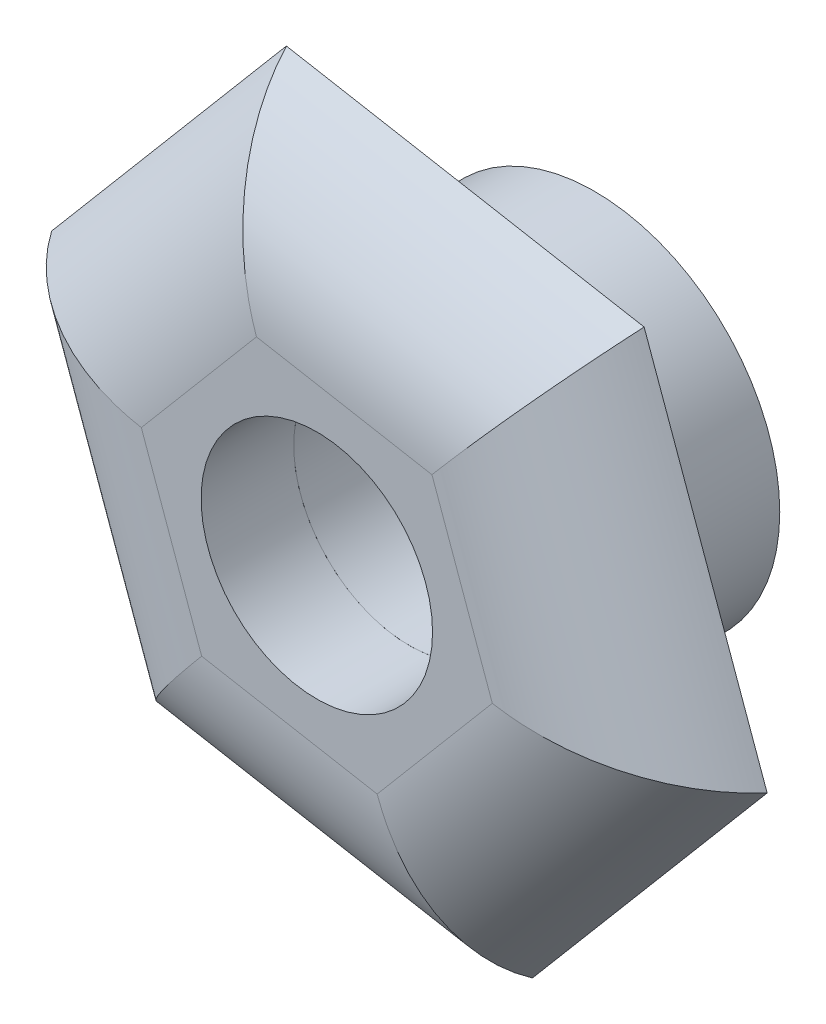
ISO-10303-21;
HEADER;
FILE_DESCRIPTION(('STEP AP214'),'2;1');
FILE_NAME('part.step','',(''),(''),'','','');
FILE_SCHEMA(('AUTOMOTIVE_DESIGN { 1 0 10303 214 1 1 1 1 }'));
ENDSEC;
DATA;
#1=APPLICATION_CONTEXT('core data for automotive mechanical design processes');
#2=APPLICATION_PROTOCOL_DEFINITION('international standard','automotive_design',2000,#1);
#3=PRODUCT_CONTEXT('',#1,'mechanical');
#4=PRODUCT('Part','Part','',(#3));
#5=PRODUCT_RELATED_PRODUCT_CATEGORY('part','',(#4));
#6=PRODUCT_DEFINITION_FORMATION('','',#4);
#7=PRODUCT_DEFINITION_CONTEXT('part definition',#1,'design');
#8=PRODUCT_DEFINITION('design','',#6,#7);
#9=PRODUCT_DEFINITION_SHAPE('','',#8);
#10=(LENGTH_UNIT() NAMED_UNIT(*) SI_UNIT(.MILLI.,.METRE.));
#11=(NAMED_UNIT(*) PLANE_ANGLE_UNIT() SI_UNIT($,.RADIAN.));
#12=(NAMED_UNIT(*) SI_UNIT($,.STERADIAN.) SOLID_ANGLE_UNIT());
#13=UNCERTAINTY_MEASURE_WITH_UNIT(LENGTH_MEASURE(1.E-05),#10,'distance_accuracy_value','');
#14=(GEOMETRIC_REPRESENTATION_CONTEXT(3) GLOBAL_UNCERTAINTY_ASSIGNED_CONTEXT((#13)) GLOBAL_UNIT_ASSIGNED_CONTEXT((#10,
#11,#12)) REPRESENTATION_CONTEXT('',''));
#15=CARTESIAN_POINT('',(0.,0.,0.));
#16=DIRECTION('',(0.,0.,1.));
#17=DIRECTION('',(1.,0.,0.));
#18=AXIS2_PLACEMENT_3D('',#15,#16,#17);
#19=CARTESIAN_POINT('',(0.,0.,0.));
#20=DIRECTION('',(0.,0.,1.));
#21=DIRECTION('',(1.,0.,0.));
#22=AXIS2_PLACEMENT_3D('',#19,#20,#21);
#23=PLANE('',#22);
#24=CARTESIAN_POINT('',(-10.8900369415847,115.08761918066,0.));
#25=DIRECTION('',(0.,0.,1.));
#26=DIRECTION('',(1.,0.,0.));
#27=AXIS2_PLACEMENT_3D('',#24,#25,#26);
#28=CIRCLE('',#27,1.24999999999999);
#29=CARTESIAN_POINT('',(-9.64003694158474,115.08761918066,0.));
#30=VERTEX_POINT('',#29);
#31=EDGE_CURVE('E135',#30,#30,#28,.T.);
#32=ORIENTED_EDGE('',*,*,#31,.T.);
#33=EDGE_LOOP('',(#32));
#34=FACE_BOUND('',#33,.T.);
#35=DIRECTION('',(0.6456997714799,0.763591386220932,0.));
#36=VECTOR('',#35,1.);
#37=CARTESIAN_POINT('',(-9.56132901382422,111.393317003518,0.));
#38=LINE('',#37,#36);
#39=CARTESIAN_POINT('',(-9.56132901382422,111.393317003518,0.));
#40=VERTEX_POINT('',#39);
#41=CARTESIAN_POINT('',(-7.02632344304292,114.39116291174,0.));
#42=VERTEX_POINT('',#41);
#43=EDGE_CURVE('E106',#40,#42,#38,.T.);
#44=ORIENTED_EDGE('',*,*,#43,.F.);
#45=DIRECTION('',(0.984139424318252,-0.177396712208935,0.));
#46=VECTOR('',#45,1.);
#47=CARTESIAN_POINT('',(-13.425042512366,112.089773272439,0.));
#48=LINE('',#47,#46);
#49=CARTESIAN_POINT('',(-13.425042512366,112.089773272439,0.));
#50=VERTEX_POINT('',#49);
#51=EDGE_CURVE('E125',#50,#40,#48,.T.);
#52=ORIENTED_EDGE('',*,*,#51,.F.);
#53=DIRECTION('',(0.338439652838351,-0.940988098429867,0.));
#54=VECTOR('',#53,1.);
#55=CARTESIAN_POINT('',(-14.7537504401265,115.784075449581,0.));
#56=LINE('',#55,#54);
#57=CARTESIAN_POINT('',(-14.7537504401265,115.784075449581,0.));
#58=VERTEX_POINT('',#57);
#59=EDGE_CURVE('E122',#58,#50,#56,.T.);
#60=ORIENTED_EDGE('',*,*,#59,.F.);
#61=DIRECTION('',(-0.6456997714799,-0.763591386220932,0.));
#62=VECTOR('',#61,1.);
#63=CARTESIAN_POINT('',(-12.2187448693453,118.781921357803,0.));
#64=LINE('',#63,#62);
#65=CARTESIAN_POINT('',(-12.2187448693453,118.781921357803,0.));
#66=VERTEX_POINT('',#65);
#67=EDGE_CURVE('E116',#66,#58,#64,.T.);
#68=ORIENTED_EDGE('',*,*,#67,.F.);
#69=DIRECTION('',(-0.984139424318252,0.177396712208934,0.));
#70=VECTOR('',#69,1.);
#71=CARTESIAN_POINT('',(-8.35503137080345,118.085465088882,0.));
#72=LINE('',#71,#70);
#73=CARTESIAN_POINT('',(-8.35503137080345,118.085465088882,0.));
#74=VERTEX_POINT('',#73);
#75=EDGE_CURVE('E114',#74,#66,#72,.T.);
#76=ORIENTED_EDGE('',*,*,#75,.F.);
#77=DIRECTION('',(-0.338439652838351,0.940988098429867,0.));
#78=VECTOR('',#77,1.);
#79=CARTESIAN_POINT('',(-7.02632344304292,114.39116291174,0.));
#80=LINE('',#79,#78);
#81=EDGE_CURVE('E99',#42,#74,#80,.T.);
#82=ORIENTED_EDGE('',*,*,#81,.F.);
#83=EDGE_LOOP('',(#44,#52,#60,#68,#76,#82));
#84=FACE_BOUND('',#83,.T.);
#85=ADVANCED_FACE('F42',(#34,#84),#23,.F.);
#86=CARTESIAN_POINT('',(0.,0.,1.));
#87=DIRECTION('',(0.,0.,1.));
#88=DIRECTION('',(1.,0.,0.));
#89=AXIS2_PLACEMENT_3D('',#86,#87,#88);
#90=PLANE('',#89);
#91=CARTESIAN_POINT('',(-10.8900369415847,115.08761918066,1.));
#92=DIRECTION('',(0.,0.,1.));
#93=DIRECTION('',(1.,0.,0.));
#94=AXIS2_PLACEMENT_3D('',#91,#92,#93);
#95=CIRCLE('',#94,1.24999999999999);
#96=CARTESIAN_POINT('',(-9.64003694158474,115.08761918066,1.));
#97=VERTEX_POINT('',#96);
#98=EDGE_CURVE('E46',#97,#97,#95,.T.);
#99=ORIENTED_EDGE('',*,*,#98,.F.);
#100=EDGE_LOOP('',(#99));
#101=FACE_BOUND('',#100,.T.);
#102=DIRECTION('',(0.6456997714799,0.763591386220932,0.));
#103=VECTOR('',#102,1.);
#104=CARTESIAN_POINT('',(-8.34890252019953,115.509547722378,1.));
#105=LINE('',#104,#103);
#106=CARTESIAN_POINT('',(-10.2382083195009,113.275293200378,1.));
#107=VERTEX_POINT('',#106);
#108=CARTESIAN_POINT('',(-8.99460229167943,114.745956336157,1.));
#109=VERTEX_POINT('',#108);
#110=EDGE_CURVE('E51',#107,#109,#105,.T.);
#111=ORIENTED_EDGE('',*,*,#110,.T.);
#112=DIRECTION('',(-0.338439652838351,0.940988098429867,0.));
#113=VECTOR('',#112,1.);
#114=CARTESIAN_POINT('',(-9.9848705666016,117.49927041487,1.));
#115=LINE('',#114,#113);
#116=CARTESIAN_POINT('',(-9.64643091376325,116.55828231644,1.));
#117=VERTEX_POINT('',#116);
#118=EDGE_CURVE('E12',#109,#117,#115,.T.);
#119=ORIENTED_EDGE('',*,*,#118,.T.);
#120=DIRECTION('',(-0.984139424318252,0.177396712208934,0.));
#121=VECTOR('',#120,1.);
#122=CARTESIAN_POINT('',(-12.5260049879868,117.077341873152,1.));
#123=LINE('',#122,#121);
#124=CARTESIAN_POINT('',(-11.5418655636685,116.899945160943,1.));
#125=VERTEX_POINT('',#124);
#126=EDGE_CURVE('E127',#117,#125,#123,.T.);
#127=ORIENTED_EDGE('',*,*,#126,.T.);
#128=DIRECTION('',(-0.6456997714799,-0.763591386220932,0.));
#129=VECTOR('',#128,1.);
#130=CARTESIAN_POINT('',(-13.4311713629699,114.665690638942,1.));
#131=LINE('',#130,#129);
#132=CARTESIAN_POINT('',(-12.78547159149,115.429282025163,1.));
#133=VERTEX_POINT('',#132);
#134=EDGE_CURVE('E129',#125,#133,#131,.T.);
#135=ORIENTED_EDGE('',*,*,#134,.T.);
#136=DIRECTION('',(0.338439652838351,-0.940988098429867,0.));
#137=VECTOR('',#136,1.);
#138=CARTESIAN_POINT('',(-11.7952033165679,112.675967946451,1.));
#139=LINE('',#138,#137);
#140=CARTESIAN_POINT('',(-12.1336429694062,113.616956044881,1.));
#141=VERTEX_POINT('',#140);
#142=EDGE_CURVE('E131',#133,#141,#139,.T.);
#143=ORIENTED_EDGE('',*,*,#142,.T.);
#144=DIRECTION('',(0.984139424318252,-0.177396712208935,0.));
#145=VECTOR('',#144,1.);
#146=CARTESIAN_POINT('',(-9.25406889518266,113.097896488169,1.));
#147=LINE('',#146,#145);
#148=EDGE_CURVE('E62',#141,#107,#147,.T.);
#149=ORIENTED_EDGE('',*,*,#148,.T.);
#150=EDGE_LOOP('',(#111,#119,#127,#135,#143,#149));
#151=FACE_BOUND('',#150,.T.);
#152=ADVANCED_FACE('F156',(#101,#151),#90,.T.);
#153=CARTESIAN_POINT('',(-13.1239112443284,116.370270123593,-1.));
#154=DIRECTION('',(-0.338439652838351,0.940988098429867,0.));
#155=DIRECTION('',(-0.940988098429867,-0.338439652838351,0.));
#156=AXIS2_PLACEMENT_3D('',#153,#154,#155);
#157=CYLINDRICAL_SURFACE('',#156,2.);
#158=CARTESIAN_POINT('',(-12.78547159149,115.429282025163,-1.));
#159=DIRECTION('',(0.177396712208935,0.984139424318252,0.));
#160=DIRECTION('',(0.984139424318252,-0.177396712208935,0.));
#161=AXIS2_PLACEMENT_3D('',#158,#159,#160);
#162=ELLIPSE('',#161,2.3094010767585,2.);
#163=EDGE_CURVE('E140',#58,#133,#162,.T.);
#164=ORIENTED_EDGE('',*,*,#163,.F.);
#165=ORIENTED_EDGE('',*,*,#59,.T.);
#166=CARTESIAN_POINT('',(-12.1336429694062,113.616956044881,-1.));
#167=DIRECTION('',(-0.763591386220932,0.645699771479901,0.));
#168=DIRECTION('',(0.645699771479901,0.763591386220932,0.));
#169=AXIS2_PLACEMENT_3D('',#166,#167,#168);
#170=ELLIPSE('',#169,2.3094010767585,2.);
#171=EDGE_CURVE('E111',#141,#50,#170,.F.);
#172=ORIENTED_EDGE('',*,*,#171,.F.);
#173=ORIENTED_EDGE('',*,*,#142,.F.);
#174=EDGE_LOOP('',(#164,#165,#172,#173));
#175=FACE_BOUND('',#174,.T.);
#176=ADVANCED_FACE('F44',(#175),#157,.T.);
#177=CARTESIAN_POINT('',(-13.1177823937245,113.79435275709,-1.));
#178=DIRECTION('',(-0.984139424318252,0.177396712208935,0.));
#179=DIRECTION('',(-0.177396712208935,-0.984139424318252,0.));
#180=AXIS2_PLACEMENT_3D('',#177,#178,#179);
#181=CYLINDRICAL_SURFACE('',#180,2.);
#182=ORIENTED_EDGE('',*,*,#171,.T.);
#183=ORIENTED_EDGE('',*,*,#51,.T.);
#184=CARTESIAN_POINT('',(-10.2382083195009,113.275293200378,-1.));
#185=DIRECTION('',(-0.940988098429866,-0.338439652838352,0.));
#186=DIRECTION('',(-0.338439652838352,0.940988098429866,0.));
#187=AXIS2_PLACEMENT_3D('',#184,#185,#186);
#188=ELLIPSE('',#187,2.3094010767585,2.);
#189=EDGE_CURVE('E108',#107,#40,#188,.F.);
#190=ORIENTED_EDGE('',*,*,#189,.F.);
#191=ORIENTED_EDGE('',*,*,#148,.F.);
#192=EDGE_LOOP('',(#182,#183,#190,#191));
#193=FACE_BOUND('',#192,.T.);
#194=ADVANCED_FACE('F145',(#193),#181,.T.);
#195=CARTESIAN_POINT('',(-10.8961657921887,117.663536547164,-1.));
#196=DIRECTION('',(0.6456997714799,0.763591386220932,0.));
#197=DIRECTION('',(-0.763591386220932,0.6456997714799,0.));
#198=AXIS2_PLACEMENT_3D('',#195,#196,#197);
#199=CYLINDRICAL_SURFACE('',#198,2.);
#200=ORIENTED_EDGE('',*,*,#163,.T.);
#201=ORIENTED_EDGE('',*,*,#134,.F.);
#202=CARTESIAN_POINT('',(-11.5418655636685,116.899945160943,-1.));
#203=DIRECTION('',(0.940988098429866,0.338439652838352,0.));
#204=DIRECTION('',(0.338439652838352,-0.940988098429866,0.));
#205=AXIS2_PLACEMENT_3D('',#202,#203,#204);
#206=ELLIPSE('',#205,2.3094010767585,2.);
#207=EDGE_CURVE('E102',#66,#125,#206,.T.);
#208=ORIENTED_EDGE('',*,*,#207,.F.);
#209=ORIENTED_EDGE('',*,*,#67,.T.);
#210=EDGE_LOOP('',(#200,#201,#208,#209));
#211=FACE_BOUND('',#210,.T.);
#212=ADVANCED_FACE('F152',(#211),#199,.T.);
#213=CARTESIAN_POINT('',(-10.8839080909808,112.511701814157,-1.));
#214=DIRECTION('',(-0.6456997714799,-0.763591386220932,0.));
#215=DIRECTION('',(0.763591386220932,-0.6456997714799,0.));
#216=AXIS2_PLACEMENT_3D('',#213,#214,#215);
#217=CYLINDRICAL_SURFACE('',#216,2.);
#218=ORIENTED_EDGE('',*,*,#189,.T.);
#219=ORIENTED_EDGE('',*,*,#43,.T.);
#220=CARTESIAN_POINT('',(-8.99460229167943,114.745956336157,-1.));
#221=DIRECTION('',(-0.177396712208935,-0.984139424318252,0.));
#222=DIRECTION('',(-0.984139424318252,0.177396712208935,0.));
#223=AXIS2_PLACEMENT_3D('',#220,#221,#222);
#224=ELLIPSE('',#223,2.3094010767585,2.);
#225=EDGE_CURVE('E95',#109,#42,#224,.F.);
#226=ORIENTED_EDGE('',*,*,#225,.F.);
#227=ORIENTED_EDGE('',*,*,#110,.F.);
#228=EDGE_LOOP('',(#218,#219,#226,#227));
#229=FACE_BOUND('',#228,.T.);
#230=ADVANCED_FACE('F107',(#229),#217,.T.);
#231=CARTESIAN_POINT('',(-8.66229148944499,116.380885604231,-1.));
#232=DIRECTION('',(0.984139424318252,-0.177396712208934,0.));
#233=DIRECTION('',(0.177396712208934,0.984139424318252,0.));
#234=AXIS2_PLACEMENT_3D('',#231,#232,#233);
#235=CYLINDRICAL_SURFACE('',#234,2.);
#236=ORIENTED_EDGE('',*,*,#207,.T.);
#237=ORIENTED_EDGE('',*,*,#126,.F.);
#238=CARTESIAN_POINT('',(-9.64643091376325,116.55828231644,-1.));
#239=DIRECTION('',(0.763591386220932,-0.645699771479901,0.));
#240=DIRECTION('',(0.6456997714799,0.763591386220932,0.));
#241=AXIS2_PLACEMENT_3D('',#238,#239,#240);
#242=ELLIPSE('',#241,2.3094010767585,2.);
#243=EDGE_CURVE('E103',#74,#117,#242,.T.);
#244=ORIENTED_EDGE('',*,*,#243,.F.);
#245=ORIENTED_EDGE('',*,*,#75,.T.);
#246=EDGE_LOOP('',(#236,#237,#244,#245));
#247=FACE_BOUND('',#246,.T.);
#248=ADVANCED_FACE('F155',(#247),#235,.T.);
#249=CARTESIAN_POINT('',(-8.65616263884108,113.804968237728,-1.));
#250=DIRECTION('',(0.338439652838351,-0.940988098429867,0.));
#251=DIRECTION('',(0.940988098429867,0.338439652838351,0.));
#252=AXIS2_PLACEMENT_3D('',#249,#250,#251);
#253=CYLINDRICAL_SURFACE('',#252,2.);
#254=ORIENTED_EDGE('',*,*,#225,.T.);
#255=ORIENTED_EDGE('',*,*,#81,.T.);
#256=ORIENTED_EDGE('',*,*,#243,.T.);
#257=ORIENTED_EDGE('',*,*,#118,.F.);
#258=EDGE_LOOP('',(#254,#255,#256,#257));
#259=FACE_BOUND('',#258,.T.);
#260=ADVANCED_FACE('F97',(#259),#253,.T.);
#261=CARTESIAN_POINT('',(-10.8900369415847,115.08761918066,-2.));
#262=DIRECTION('',(0.,0.,-1.));
#263=DIRECTION('',(-1.,0.,0.));
#264=AXIS2_PLACEMENT_3D('',#261,#262,#263);
#265=CYLINDRICAL_SURFACE('',#264,1.24999999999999);
#266=ORIENTED_EDGE('',*,*,#98,.T.);
#267=EDGE_LOOP('',(#266));
#268=FACE_BOUND('',#267,.T.);
#269=ORIENTED_EDGE('',*,*,#31,.F.);
#270=EDGE_LOOP('',(#269));
#271=FACE_BOUND('',#270,.T.);
#272=ADVANCED_FACE('F171',(#268,#271),#265,.F.);
#273=CLOSED_SHELL('',(#85,#152,#176,#194,#212,#230,#248,#260,#272));
#274=MANIFOLD_SOLID_BREP('B2',#273);
#275=CARTESIAN_POINT('',(0.,0.,0.));
#276=DIRECTION('',(0.,0.,1.));
#277=DIRECTION('',(1.,0.,0.));
#278=AXIS2_PLACEMENT_3D('',#275,#276,#277);
#279=PLANE('',#278);
#280=CARTESIAN_POINT('',(-10.8900369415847,115.08761918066,0.));
#281=DIRECTION('',(0.,0.,1.));
#282=DIRECTION('',(1.,0.,0.));
#283=AXIS2_PLACEMENT_3D('',#280,#281,#282);
#284=CIRCLE('',#283,1.24999999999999);
#285=CARTESIAN_POINT('',(-9.64003694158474,115.08761918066,0.));
#286=VERTEX_POINT('',#285);
#287=EDGE_CURVE('E251',#286,#286,#284,.T.);
#288=ORIENTED_EDGE('',*,*,#287,.F.);
#289=EDGE_LOOP('',(#288));
#290=FACE_BOUND('',#289,.T.);
#291=CARTESIAN_POINT('',(-10.8900369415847,115.08761918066,0.));
#292=DIRECTION('',(0.,0.,1.));
#293=DIRECTION('',(1.,0.,0.));
#294=AXIS2_PLACEMENT_3D('',#291,#292,#293);
#295=CIRCLE('',#294,2.);
#296=CARTESIAN_POINT('',(-8.89003694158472,115.08761918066,0.));
#297=VERTEX_POINT('',#296);
#298=EDGE_CURVE('E247',#297,#297,#295,.F.);
#299=ORIENTED_EDGE('',*,*,#298,.F.);
#300=EDGE_LOOP('',(#299));
#301=FACE_BOUND('',#300,.T.);
#302=ADVANCED_FACE('F240',(#290,#301),#279,.T.);
#303=CARTESIAN_POINT('',(-10.8900369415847,115.08761918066,-2.));
#304=DIRECTION('',(0.,0.,1.));
#305=DIRECTION('',(1.,0.,0.));
#306=AXIS2_PLACEMENT_3D('',#303,#304,#305);
#307=CYLINDRICAL_SURFACE('',#306,2.);
#308=CARTESIAN_POINT('',(-10.8900369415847,115.08761918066,-2.));
#309=DIRECTION('',(0.,0.,1.));
#310=DIRECTION('',(1.,0.,0.));
#311=AXIS2_PLACEMENT_3D('',#308,#309,#310);
#312=CIRCLE('',#311,2.);
#313=CARTESIAN_POINT('',(-8.89003694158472,115.08761918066,-2.));
#314=VERTEX_POINT('',#313);
#315=EDGE_CURVE('E41',#314,#314,#312,.T.);
#316=ORIENTED_EDGE('',*,*,#315,.T.);
#317=EDGE_LOOP('',(#316));
#318=FACE_BOUND('',#317,.T.);
#319=ORIENTED_EDGE('',*,*,#298,.T.);
#320=EDGE_LOOP('',(#319));
#321=FACE_BOUND('',#320,.T.);
#322=ADVANCED_FACE('F242',(#318,#321),#307,.T.);
#323=CARTESIAN_POINT('',(-10.8900369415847,115.08761918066,-2.));
#324=DIRECTION('',(0.,0.,1.));
#325=DIRECTION('',(1.,0.,0.));
#326=AXIS2_PLACEMENT_3D('',#323,#324,#325);
#327=PLANE('',#326);
#328=CARTESIAN_POINT('',(-10.8900369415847,115.08761918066,-2.));
#329=DIRECTION('',(0.,0.,-1.));
#330=DIRECTION('',(-1.,0.,0.));
#331=AXIS2_PLACEMENT_3D('',#328,#329,#330);
#332=CIRCLE('',#331,1.24999999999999);
#333=CARTESIAN_POINT('',(-12.1400369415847,115.08761918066,-2.));
#334=VERTEX_POINT('',#333);
#335=EDGE_CURVE('E255',#334,#334,#332,.T.);
#336=ORIENTED_EDGE('',*,*,#335,.F.);
#337=EDGE_LOOP('',(#336));
#338=FACE_BOUND('',#337,.T.);
#339=ORIENTED_EDGE('',*,*,#315,.F.);
#340=EDGE_LOOP('',(#339));
#341=FACE_BOUND('',#340,.T.);
#342=ADVANCED_FACE('F263',(#338,#341),#327,.F.);
#343=CARTESIAN_POINT('',(-10.8900369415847,115.08761918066,-2.));
#344=DIRECTION('',(0.,0.,-1.));
#345=DIRECTION('',(-1.,0.,0.));
#346=AXIS2_PLACEMENT_3D('',#343,#344,#345);
#347=CYLINDRICAL_SURFACE('',#346,1.24999999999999);
#348=ORIENTED_EDGE('',*,*,#287,.T.);
#349=EDGE_LOOP('',(#348));
#350=FACE_BOUND('',#349,.T.);
#351=ORIENTED_EDGE('',*,*,#335,.T.);
#352=EDGE_LOOP('',(#351));
#353=FACE_BOUND('',#352,.T.);
#354=ADVANCED_FACE('F261',(#350,#353),#347,.F.);
#355=CLOSED_SHELL('',(#302,#322,#342,#354));
#356=MANIFOLD_SOLID_BREP('B6',#355);
#357=ADVANCED_BREP_SHAPE_REPRESENTATION('',(#18,#274,#356),#14);
#358=SHAPE_DEFINITION_REPRESENTATION(#9,#357);
ENDSEC;
END-ISO-10303-21;
